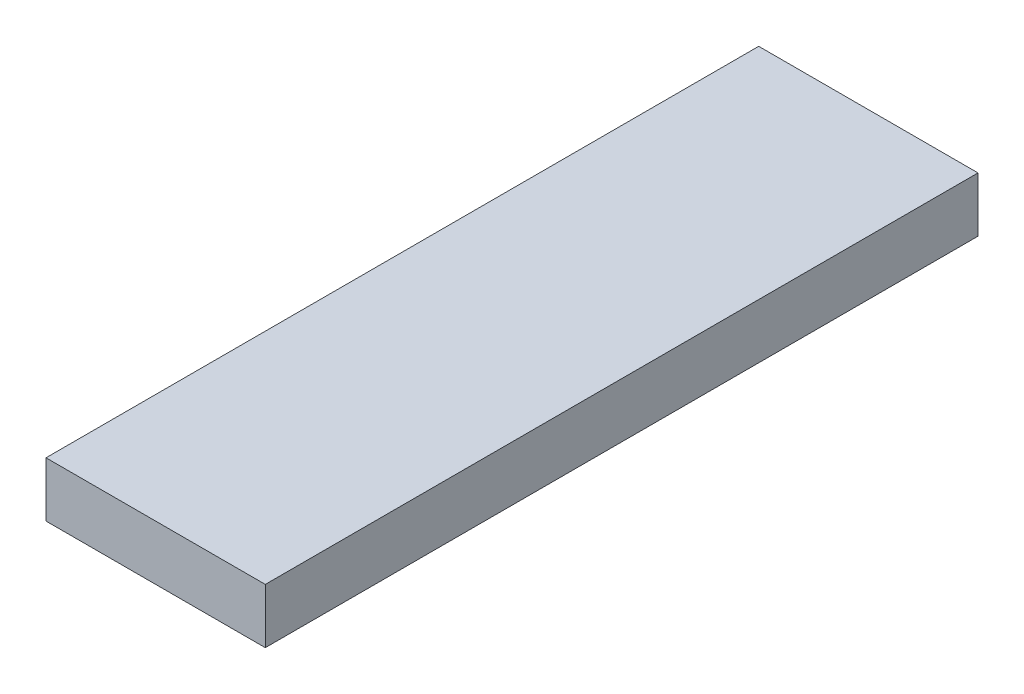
from build123d import *

# Parameters (mm, degrees)
SKETCH1_W           = 50.8
SKETCH1_H           = 12.7
BOSS_EXTRUDE1_DEPTH = 165.1


with BuildPart() as part:
    # Sketch1 → Boss-Extrude1 (new body)
    with BuildSketch(Plane.XY):
        Rectangle(SKETCH1_W, SKETCH1_H)
    extrude(amount=BOSS_EXTRUDE1_DEPTH)


solid = part.part
